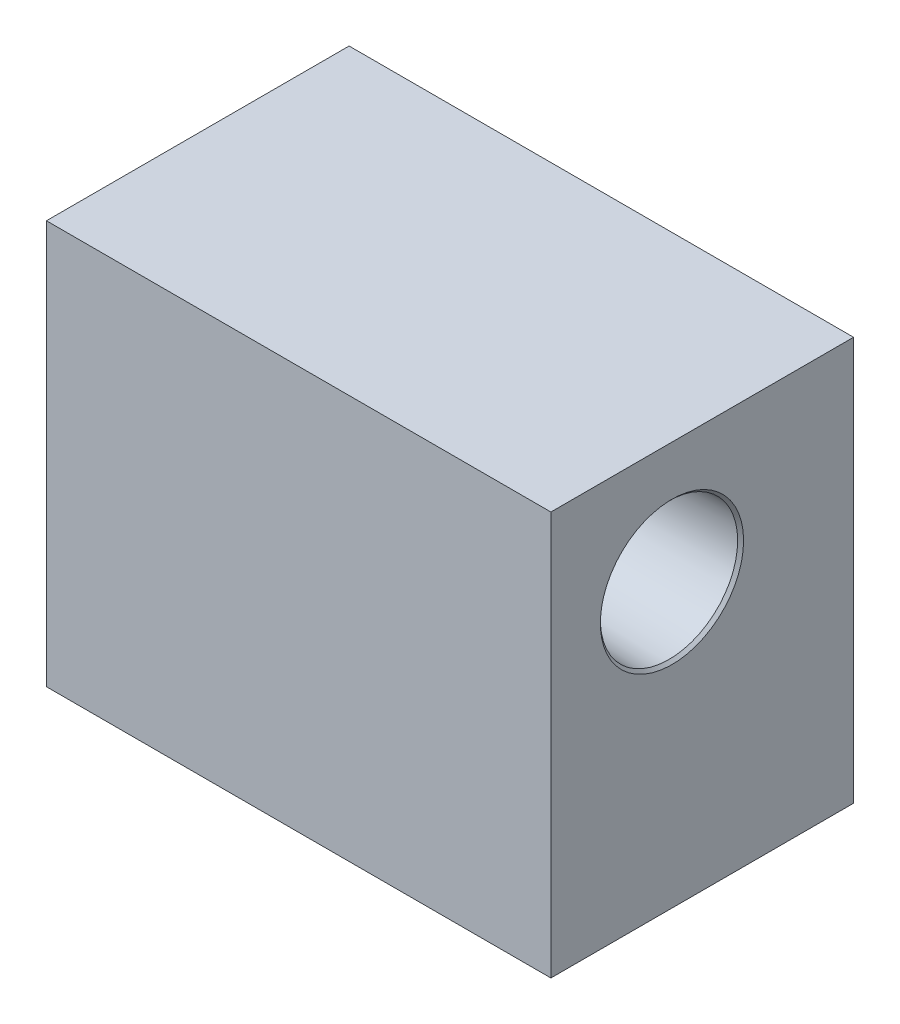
from build123d import *

# Parameters (mm, degrees)
SKETCH1_W           = 63.5
SKETCH1_H           = 50.8
BOSS_EXTRUDE1_DEPTH = 38.1


with BuildPart() as part:
    # Sketch1 → Boss-Extrude1 (new body)
    with BuildSketch(Plane.XY):
        with Locations((31.75, 25.4)):
            Rectangle(SKETCH1_W, SKETCH1_H)
    extrude(amount=BOSS_EXTRUDE1_DEPTH)

    # Sketch2 → 3_4 NPT Tapped Hole1 (revolve, cut)
    with BuildSketch(Plane(origin=(31.75, 0, 19.05), x_dir=(0, 0, -1), z_dir=(1, 0, 0))):
        Polygon((0, 0), (0, 45.013622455), (11.5062, 38.1), (11.5062, 13.97), (12.933217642, 13.97), (13.3324854, 0.635), (13.9674854, 0), align=None)
    revolve(axis=Axis((31.75, -6.35, 19.05), (0, 1, 0)), mode=Mode.SUBTRACT)

    # Sketch6 → 3_8 NPT Tapped Hole1 (revolve, cut)
    with BuildSketch(Plane(origin=(63.5, 35.56, 22.86), x_dir=(0, 0, -1), z_dir=(0, 1, 0))):
        Polygon((0, 0), (0, 36.038582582), (7.1374, 31.75), (7.1374, 12.7), (8.274384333, 12.7), (8.6434549, 0.3735451), (9.017, 0), align=None)
    revolve(axis=Axis((69.85, 35.56, 22.86), (-1, 0, 0)), mode=Mode.SUBTRACT)

    # Sketch8 → 3_8 NPT Tapped Hole2 (revolve, cut)
    with BuildSketch(Plane(origin=(0, 35.56, 15.24), x_dir=(0, 0, 1), z_dir=(0, 1, 0))):
        Polygon((0, 0), (0, 36.038582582), (7.1374, 31.75), (7.1374, 12.7), (8.274384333, 12.7), (8.6434549, 0.3735451), (9.017, 0), align=None)
    revolve(axis=Axis((-6.35, 35.56, 15.24), (1, 0, 0)), mode=Mode.SUBTRACT)


solid = part.part
